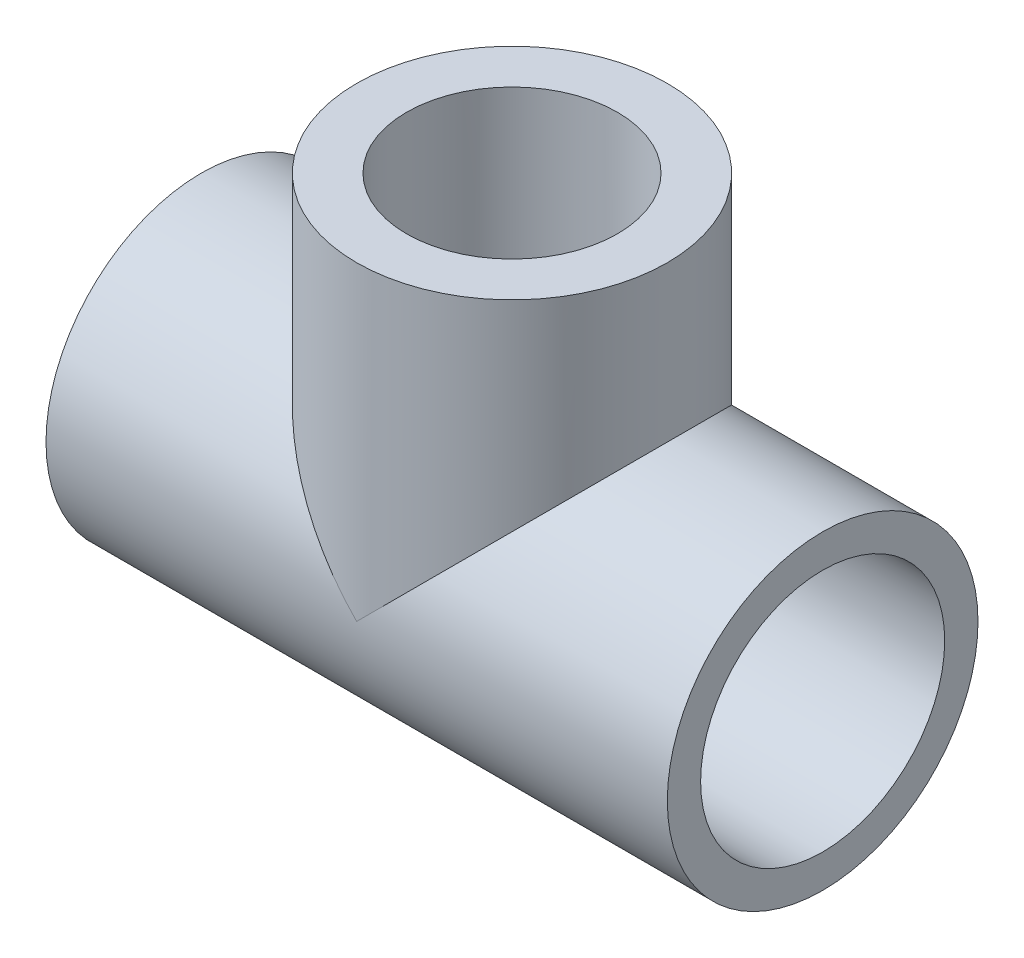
ISO-10303-21;
HEADER;
FILE_DESCRIPTION(('STEP AP214'),'2;1');
FILE_NAME('part.step','',(''),(''),'','','');
FILE_SCHEMA(('AUTOMOTIVE_DESIGN { 1 0 10303 214 1 1 1 1 }'));
ENDSEC;
DATA;
#1=APPLICATION_CONTEXT('core data for automotive mechanical design processes');
#2=APPLICATION_PROTOCOL_DEFINITION('international standard','automotive_design',2000,#1);
#3=PRODUCT_CONTEXT('',#1,'mechanical');
#4=PRODUCT('Part','Part','',(#3));
#5=PRODUCT_RELATED_PRODUCT_CATEGORY('part','',(#4));
#6=PRODUCT_DEFINITION_FORMATION('','',#4);
#7=PRODUCT_DEFINITION_CONTEXT('part definition',#1,'design');
#8=PRODUCT_DEFINITION('design','',#6,#7);
#9=PRODUCT_DEFINITION_SHAPE('','',#8);
#10=(LENGTH_UNIT() NAMED_UNIT(*) SI_UNIT(.MILLI.,.METRE.));
#11=(NAMED_UNIT(*) PLANE_ANGLE_UNIT() SI_UNIT($,.RADIAN.));
#12=(NAMED_UNIT(*) SI_UNIT($,.STERADIAN.) SOLID_ANGLE_UNIT());
#13=UNCERTAINTY_MEASURE_WITH_UNIT(LENGTH_MEASURE(1.E-05),#10,'distance_accuracy_value','');
#14=(GEOMETRIC_REPRESENTATION_CONTEXT(3) GLOBAL_UNCERTAINTY_ASSIGNED_CONTEXT((#13)) GLOBAL_UNIT_ASSIGNED_CONTEXT((#10,
#11,#12)) REPRESENTATION_CONTEXT('',''));
#15=CARTESIAN_POINT('',(0.,0.,0.));
#16=DIRECTION('',(0.,0.,1.));
#17=DIRECTION('',(1.,0.,0.));
#18=AXIS2_PLACEMENT_3D('',#15,#16,#17);
#19=CARTESIAN_POINT('',(-86.4956498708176,0.,0.));
#20=DIRECTION('',(1.,0.,0.));
#21=DIRECTION('',(0.,0.,-1.));
#22=AXIS2_PLACEMENT_3D('',#19,#20,#21);
#23=CYLINDRICAL_SURFACE('',#22,15.494);
#24=CARTESIAN_POINT('',(17.272,0.,0.));
#25=DIRECTION('',(1.,0.,0.));
#26=DIRECTION('',(0.,0.,-1.));
#27=AXIS2_PLACEMENT_3D('',#24,#25,#26);
#28=CIRCLE('',#27,15.494);
#29=CARTESIAN_POINT('',(17.272,0.,-15.494));
#30=VERTEX_POINT('',#29);
#31=EDGE_CURVE('E82',#30,#30,#28,.F.);
#32=ORIENTED_EDGE('',*,*,#31,.F.);
#33=EDGE_LOOP('',(#32));
#34=FACE_BOUND('',#33,.T.);
#35=CARTESIAN_POINT('',(0.,5.51829248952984,14.478));
#36=CARTESIAN_POINT('',(-0.19165666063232,5.51830328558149,14.4779975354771));
#37=CARTESIAN_POINT('',(-0.383393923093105,5.52835492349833,14.4741770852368));
#38=CARTESIAN_POINT('',(-0.764660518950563,5.56778119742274,14.4590547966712));
#39=CARTESIAN_POINT('',(-0.954187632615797,5.59717379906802,14.4477460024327));
#40=CARTESIAN_POINT('',(-1.32998787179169,5.67330377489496,14.4180205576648));
#41=CARTESIAN_POINT('',(-1.516242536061,5.7201185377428,14.399572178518));
#42=CARTESIAN_POINT('',(-1.88373370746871,5.82830327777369,14.3561246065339));
#43=CARTESIAN_POINT('',(-2.06496682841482,5.88968282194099,14.3311211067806));
#44=CARTESIAN_POINT('',(-2.51949151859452,6.06084982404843,14.2598290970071));
#45=CARTESIAN_POINT('',(-2.78904956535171,6.17877523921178,14.209371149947));
#46=CARTESIAN_POINT('',(-3.31607527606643,6.43386751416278,14.0957059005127));
#47=CARTESIAN_POINT('',(-3.57353262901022,6.57105040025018,14.0324879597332));
#48=CARTESIAN_POINT('',(-4.07847666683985,6.85874685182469,13.8941425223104));
#49=CARTESIAN_POINT('',(-4.32593351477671,7.00929655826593,13.8189822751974));
#50=CARTESIAN_POINT('',(-4.81164909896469,7.31905380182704,13.6574534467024));
#51=CARTESIAN_POINT('',(-5.04990473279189,7.47826421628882,13.5710811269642));
#52=CARTESIAN_POINT('',(-5.51228113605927,7.79805593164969,13.3898203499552));
#53=CARTESIAN_POINT('',(-5.73660775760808,7.95849708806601,13.2952074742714));
#54=CARTESIAN_POINT('',(-6.17834824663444,8.2825738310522,13.095771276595));
#55=CARTESIAN_POINT('',(-6.39576107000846,8.44620989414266,12.9909464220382));
#56=CARTESIAN_POINT('',(-6.8242835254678,8.77516598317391,12.7710480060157));
#57=CARTESIAN_POINT('',(-7.03538912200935,8.94048700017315,12.6559680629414));
#58=CARTESIAN_POINT('',(-7.45144041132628,9.27144419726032,12.4155637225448));
#59=CARTESIAN_POINT('',(-7.65638551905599,9.43708040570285,12.2902383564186));
#60=CARTESIAN_POINT('',(-8.26161395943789,9.93235923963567,11.8991165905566));
#61=CARTESIAN_POINT('',(-8.65295711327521,10.2608917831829,11.6178323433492));
#62=CARTESIAN_POINT('',(-9.41057468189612,10.9074191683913,11.0130924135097));
#63=CARTESIAN_POINT('',(-9.77686358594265,11.2254200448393,10.6896614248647));
#64=CARTESIAN_POINT('',(-10.3888015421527,11.7627989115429,10.0904461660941));
#65=CARTESIAN_POINT('',(-10.6407865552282,11.9860651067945,9.82459806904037));
#66=CARTESIAN_POINT('',(-11.128146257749,12.4207504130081,9.268947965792));
#67=CARTESIAN_POINT('',(-11.363521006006,12.6321695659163,8.97914604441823));
#68=CARTESIAN_POINT('',(-11.8151977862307,13.0399790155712,8.37588007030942));
#69=CARTESIAN_POINT('',(-12.031526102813,13.2363899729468,8.06244977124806));
#70=CARTESIAN_POINT('',(-12.4428843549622,13.6113841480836,7.41182464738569));
#71=CARTESIAN_POINT('',(-12.6379191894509,13.7899714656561,7.07463531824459));
#72=CARTESIAN_POINT('',(-12.9659302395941,14.09126031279,6.44939662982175));
#73=CARTESIAN_POINT('',(-13.1034025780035,14.2178847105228,6.16558937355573));
#74=CARTESIAN_POINT('',(-13.3614666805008,14.4560671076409,5.58433110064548));
#75=CARTESIAN_POINT('',(-13.4820622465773,14.5676285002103,5.28688317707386));
#76=CARTESIAN_POINT('',(-13.7047052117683,14.7739210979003,4.67954101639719));
#77=CARTESIAN_POINT('',(-13.8067580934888,14.8686572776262,4.36965049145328));
#78=CARTESIAN_POINT('',(-13.9907362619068,15.039650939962,3.73894023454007));
#79=CARTESIAN_POINT('',(-14.0726613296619,15.1159082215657,3.41812038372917));
#80=CARTESIAN_POINT('',(-14.2154229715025,15.2489056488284,2.76526284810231));
#81=CARTESIAN_POINT('',(-14.276101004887,15.3054990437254,2.43316030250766));
#82=CARTESIAN_POINT('',(-14.3743025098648,15.3971365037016,1.76258926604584));
#83=CARTESIAN_POINT('',(-14.4118259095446,15.4321805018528,1.42412075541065));
#84=CARTESIAN_POINT('',(-14.4628932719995,15.4798821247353,0.743949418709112));
#85=CARTESIAN_POINT('',(-14.4764475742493,15.4925494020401,0.40224805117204));
#86=CARTESIAN_POINT('',(-14.4792999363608,15.4952146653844,-0.281326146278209));
#87=CARTESIAN_POINT('',(-14.4686002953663,15.4852148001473,-0.623198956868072));
#88=CARTESIAN_POINT('',(-14.4258279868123,15.4452587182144,-1.26452252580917));
#89=CARTESIAN_POINT('',(-14.3963701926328,15.4177441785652,-1.56430690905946));
#90=CARTESIAN_POINT('',(-14.3191974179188,15.3457086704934,-2.15941606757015));
#91=CARTESIAN_POINT('',(-14.2714841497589,15.3011892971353,-2.45474125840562));
#92=CARTESIAN_POINT('',(-14.1585672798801,15.1959258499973,-3.0390836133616));
#93=CARTESIAN_POINT('',(-14.0933626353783,15.1351808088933,-3.32810040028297));
#94=CARTESIAN_POINT('',(-13.9464355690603,14.9984630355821,-3.89821627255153));
#95=CARTESIAN_POINT('',(-13.8647122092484,14.9224894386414,-4.17931490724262));
#96=CARTESIAN_POINT('',(-13.6828881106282,14.7537045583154,-4.74143313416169));
#97=CARTESIAN_POINT('',(-13.5822683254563,14.6604189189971,-5.02214171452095));
#98=CARTESIAN_POINT('',(-13.3658223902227,14.4601202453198,-5.57268451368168));
#99=CARTESIAN_POINT('',(-13.2499903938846,14.353101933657,-5.84251449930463));
#100=CARTESIAN_POINT('',(-13.004427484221,14.1267271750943,-6.37040808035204));
#101=CARTESIAN_POINT('',(-12.8746959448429,14.0073701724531,-6.62847114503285));
#102=CARTESIAN_POINT('',(-12.6025574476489,13.7576554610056,-7.13232445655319));
#103=CARTESIAN_POINT('',(-12.4601477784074,13.627295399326,-7.37811206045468));
#104=CARTESIAN_POINT('',(-12.0864527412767,13.2862845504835,-7.98209368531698));
#105=CARTESIAN_POINT('',(-11.8475680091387,13.0692331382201,-8.33201624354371));
#106=CARTESIAN_POINT('',(-11.3466371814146,12.6168985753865,-9.00230755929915));
#107=CARTESIAN_POINT('',(-11.0845808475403,12.3816073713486,-9.3226631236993));
#108=CARTESIAN_POINT('',(-10.5395809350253,11.8961721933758,-9.93468778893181));
#109=CARTESIAN_POINT('',(-10.2565883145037,11.6459936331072,-10.2262855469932));
#110=CARTESIAN_POINT('',(-9.6725165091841,11.1350385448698,-10.7803971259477));
#111=CARTESIAN_POINT('',(-9.37144012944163,10.8742636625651,-11.0429154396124));
#112=CARTESIAN_POINT('',(-8.74477901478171,10.3390242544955,-11.5458570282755));
#113=CARTESIAN_POINT('',(-8.41876770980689,10.0643803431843,-11.785556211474));
#114=CARTESIAN_POINT('',(-7.74973818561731,9.51179882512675,-12.2358790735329));
#115=CARTESIAN_POINT('',(-7.40671533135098,9.23386033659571,-12.446494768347));
#116=CARTESIAN_POINT('',(-6.70405490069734,8.68038106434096,-12.8386016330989));
#117=CARTESIAN_POINT('',(-6.34445695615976,8.4048362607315,-13.0201580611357));
#118=CARTESIAN_POINT('',(-5.60620728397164,7.86244944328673,-13.35467009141));
#119=CARTESIAN_POINT('',(-5.2275677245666,7.59560204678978,-13.5076436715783));
#120=CARTESIAN_POINT('',(-4.49521827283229,7.11281493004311,-13.767252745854));
#121=CARTESIAN_POINT('',(-4.14421540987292,6.894660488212,-13.8772791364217));
#122=CARTESIAN_POINT('',(-3.60110900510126,6.58767748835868,-14.0242490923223));
#123=CARTESIAN_POINT('',(-3.41722384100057,6.48868637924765,-14.0702433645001));
#124=CARTESIAN_POINT('',(-3.04342765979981,6.29983291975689,-14.1558069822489));
#125=CARTESIAN_POINT('',(-2.85351728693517,6.20996959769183,-14.1953770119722));
#126=CARTESIAN_POINT('',(-2.33791265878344,5.98608479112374,-14.2917434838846));
#127=CARTESIAN_POINT('',(-2.00613602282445,5.86258671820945,-14.3424267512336));
#128=CARTESIAN_POINT('',(-1.49615813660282,5.71521593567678,-14.401499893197));
#129=CARTESIAN_POINT('',(-1.32434629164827,5.67243640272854,-14.4183546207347));
#130=CARTESIAN_POINT('',(-0.977280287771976,5.60159095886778,-14.4460256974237));
#131=CARTESIAN_POINT('',(-0.80202849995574,5.57351525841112,-14.4568460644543));
#132=CARTESIAN_POINT('',(-0.446929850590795,5.53351404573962,-14.4722058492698));
#133=CARTESIAN_POINT('',(-0.267052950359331,5.52181663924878,-14.47665657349));
#134=CARTESIAN_POINT('',(0.0930188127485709,5.51614041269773,-14.4788204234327));
#135=CARTESIAN_POINT('',(0.273213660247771,5.52216075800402,-14.4765338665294));
#136=CARTESIAN_POINT('',(0.632280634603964,5.55150745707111,-14.4653046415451));
#137=CARTESIAN_POINT('',(0.811149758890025,5.57486527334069,-14.4563498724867));
#138=CARTESIAN_POINT('',(1.16565573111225,5.63735876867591,-14.4320937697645));
#139=CARTESIAN_POINT('',(1.3412917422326,5.676498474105,-14.4167908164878));
#140=CARTESIAN_POINT('',(1.73236249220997,5.78001696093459,-14.3756482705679));
#141=CARTESIAN_POINT('',(1.94658261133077,5.84828047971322,-14.3481200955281));
#142=CARTESIAN_POINT('',(2.36761439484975,6.00155090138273,-14.2846869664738));
#143=CARTESIAN_POINT('',(2.57442285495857,6.08656494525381,-14.2487784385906));
#144=CARTESIAN_POINT('',(2.98147240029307,6.26957440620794,-14.1692081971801));
#145=CARTESIAN_POINT('',(3.18168850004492,6.36761339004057,-14.1255202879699));
#146=CARTESIAN_POINT('',(3.57548064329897,6.57323445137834,-14.0310171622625));
#147=CARTESIAN_POINT('',(3.76905368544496,6.68082076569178,-13.9801987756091));
#148=CARTESIAN_POINT('',(4.16493414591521,6.91161183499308,-13.8676379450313));
#149=CARTESIAN_POINT('',(4.3667564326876,7.0353808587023,-13.8053542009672));
#150=CARTESIAN_POINT('',(4.76414203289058,7.28870776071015,-13.6733035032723));
#151=CARTESIAN_POINT('',(4.95970606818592,7.41826496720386,-13.6035374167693));
#152=CARTESIAN_POINT('',(5.53845530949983,7.81318601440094,-13.3831541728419));
#153=CARTESIAN_POINT('',(5.91337330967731,8.08460273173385,-13.2215455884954));
#154=CARTESIAN_POINT('',(6.64495470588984,8.63418346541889,-12.8694170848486));
#155=CARTESIAN_POINT('',(7.00159164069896,8.91235644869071,-12.6788567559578));
#156=CARTESIAN_POINT('',(7.69747384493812,9.4688495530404,-12.2688367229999));
#157=CARTESIAN_POINT('',(8.03672564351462,9.74716957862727,-12.0493879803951));
#158=CARTESIAN_POINT('',(8.73504006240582,10.3301293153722,-11.5548458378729));
#159=CARTESIAN_POINT('',(9.09209220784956,10.6342424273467,-11.2762760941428));
#160=CARTESIAN_POINT('',(9.783856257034,11.2314301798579,-10.6816041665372));
#161=CARTESIAN_POINT('',(10.118561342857,11.5245014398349,-10.3654906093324));
#162=CARTESIAN_POINT('',(10.7619322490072,12.0933142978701,-9.69578863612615));
#163=CARTESIAN_POINT('',(11.0706667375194,12.3691010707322,-9.34230500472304));
#164=CARTESIAN_POINT('',(11.6590835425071,12.8984226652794,-8.59671359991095));
#165=CARTESIAN_POINT('',(11.9387835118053,13.1519709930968,-8.20462958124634));
#166=CARTESIAN_POINT('',(12.3729313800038,13.5475466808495,-7.52493139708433));
#167=CARTESIAN_POINT('',(12.5371677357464,13.6977464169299,-7.24826596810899));
#168=CARTESIAN_POINT('',(12.8494451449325,13.9841307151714,-6.67903895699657));
#169=CARTESIAN_POINT('',(12.9974908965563,14.1203193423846,-6.38648202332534));
#170=CARTESIAN_POINT('',(13.2755807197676,14.3767068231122,-5.78625981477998));
#171=CARTESIAN_POINT('',(13.4056294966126,14.4969098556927,-5.47859851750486));
#172=CARTESIAN_POINT('',(13.6458893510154,14.7193677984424,-4.84928916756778));
#173=CARTESIAN_POINT('',(13.7560998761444,14.8216222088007,-4.52764072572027));
#174=CARTESIAN_POINT('',(13.9557249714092,15.0070794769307,-3.86906750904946));
#175=CARTESIAN_POINT('',(14.0449377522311,15.0900973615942,-3.53202895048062));
#176=CARTESIAN_POINT('',(14.1994769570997,15.2340377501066,-2.84785927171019));
#177=CARTESIAN_POINT('',(14.2648033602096,15.2949602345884,-2.50072814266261));
#178=CARTESIAN_POINT('',(14.3700898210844,15.3932022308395,-1.79960074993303));
#179=CARTESIAN_POINT('',(14.4100693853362,15.4305398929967,-1.44560998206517));
#180=CARTESIAN_POINT('',(14.4637859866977,15.4807158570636,-0.733934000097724));
#181=CARTESIAN_POINT('',(14.4775267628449,15.4935576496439,-0.376249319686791));
#182=CARTESIAN_POINT('',(14.4783874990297,15.4943622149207,0.291101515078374));
#183=CARTESIAN_POINT('',(14.4688332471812,15.4854331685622,0.60076843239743));
#184=CARTESIAN_POINT('',(14.4300062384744,15.4491612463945,1.21775085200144));
#185=CARTESIAN_POINT('',(14.4007355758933,15.4218203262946,1.52506660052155));
#186=CARTESIAN_POINT('',(14.3230001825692,15.3492570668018,2.13511646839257));
#187=CARTESIAN_POINT('',(14.2745347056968,15.3040340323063,2.43785040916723));
#188=CARTESIAN_POINT('',(14.1592321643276,15.1965447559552,3.03671236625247));
#189=CARTESIAN_POINT('',(14.0923944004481,15.1342778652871,3.33284013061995));
#190=CARTESIAN_POINT('',(13.9426241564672,14.9949184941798,3.91199899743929));
#191=CARTESIAN_POINT('',(13.8599707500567,14.9180832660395,4.19516470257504));
#192=CARTESIAN_POINT('',(13.6790370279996,14.750134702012,4.75206875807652));
#193=CARTESIAN_POINT('',(13.5807574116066,14.6590220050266,5.0258075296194));
#194=CARTESIAN_POINT('',(13.3697506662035,14.4637541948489,5.56286804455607));
#195=CARTESIAN_POINT('',(13.2570224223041,14.3595980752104,5.82618898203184));
#196=CARTESIAN_POINT('',(13.0183045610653,14.1395074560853,6.34168379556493));
#197=CARTESIAN_POINT('',(12.8923121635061,14.0235704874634,6.59385531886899));
#198=CARTESIAN_POINT('',(12.5668757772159,13.7248683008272,7.20094454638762));
#199=CARTESIAN_POINT('',(12.3604892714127,13.5360680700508,7.54920461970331));
#200=CARTESIAN_POINT('',(11.9250228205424,13.1396194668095,8.21987393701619));
#201=CARTESIAN_POINT('',(11.6959342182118,12.9319639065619,8.54227323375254));
#202=CARTESIAN_POINT('',(11.2172986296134,12.5007403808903,9.16178555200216));
#203=CARTESIAN_POINT('',(10.9676998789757,12.2771323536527,9.45883048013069));
#204=CARTESIAN_POINT('',(10.4509052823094,11.8177396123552,10.0268896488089));
#205=CARTESIAN_POINT('',(10.1837104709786,11.5819556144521,10.2979054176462));
#206=CARTESIAN_POINT('',(9.54962934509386,11.0279798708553,10.8930947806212));
#207=CARTESIAN_POINT('',(9.17716125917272,10.7065568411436,11.2083264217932));
#208=CARTESIAN_POINT('',(8.40740099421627,10.0545374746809,11.796740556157));
#209=CARTESIAN_POINT('',(8.01009377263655,9.72393564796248,12.0698972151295));
#210=CARTESIAN_POINT('',(7.39626224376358,9.2272422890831,12.4485099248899));
#211=CARTESIAN_POINT('',(7.18877144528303,9.06162136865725,12.5694792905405));
#212=CARTESIAN_POINT('',(6.76753390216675,8.73120490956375,12.8012021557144));
#213=CARTESIAN_POINT('',(6.55378780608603,8.56640928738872,12.9119567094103));
#214=CARTESIAN_POINT('',(6.11982999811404,8.23914920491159,13.123199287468));
#215=CARTESIAN_POINT('',(5.89962320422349,8.07668310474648,13.2236948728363));
#216=CARTESIAN_POINT('',(5.45201845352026,7.75575121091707,13.4144388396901));
#217=CARTESIAN_POINT('',(5.22462193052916,7.59728463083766,13.5046892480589));
#218=CARTESIAN_POINT('',(4.80292346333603,7.3143526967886,13.6596293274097));
#219=CARTESIAN_POINT('',(4.60993624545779,7.18885632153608,13.7260092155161));
#220=CARTESIAN_POINT('',(4.21782278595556,6.94392604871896,13.8515288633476));
#221=CARTESIAN_POINT('',(4.01869639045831,6.82449230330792,13.9106684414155));
#222=CARTESIAN_POINT('',(3.61370546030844,6.5941427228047,14.0213271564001));
#223=CARTESIAN_POINT('',(3.40784746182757,6.48321895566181,14.072853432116));
#224=CARTESIAN_POINT('',(2.98858704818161,6.27297885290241,14.1678186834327));
#225=CARTESIAN_POINT('',(2.77518713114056,6.17365871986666,14.2112603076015));
#226=CARTESIAN_POINT('',(2.24109143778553,5.94910354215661,14.3070982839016));
#227=CARTESIAN_POINT('',(1.91560559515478,5.8325278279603,14.3546282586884));
#228=CARTESIAN_POINT('',(1.41595199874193,5.69481636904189,14.4095656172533));
#229=CARTESIAN_POINT('',(1.24773265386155,5.65513334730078,14.4251417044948));
#230=CARTESIAN_POINT('',(0.908160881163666,5.59004717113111,14.4504891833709));
#231=CARTESIAN_POINT('',(0.736810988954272,5.56463294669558,14.4602650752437));
#232=CARTESIAN_POINT('',(0.470841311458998,5.537555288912,14.470646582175));
#233=CARTESIAN_POINT('',(0.37684070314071,5.53034618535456,14.4734010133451));
#234=CARTESIAN_POINT('',(0.188566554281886,5.52071228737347,14.4770782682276));
#235=CARTESIAN_POINT('',(0.0942930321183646,5.51828717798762,14.4780012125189));
#236=CARTESIAN_POINT('',(0.,5.51829248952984,14.478));
#237=B_SPLINE_CURVE_WITH_KNOTS('',3,(#35,#36,#37,#38,#39,#40,#41,#42,#43,#44,#45,#46,#47,#48,
#49,#50,#51,#52,#53,#54,#55,#56,#57,#58,#59,#60,#61,#62,#63,#64,#65,#66,#67,#68,#69,#70,#71,#72,
#73,#74,#75,#76,#77,#78,#79,#80,#81,#82,#83,#84,#85,#86,#87,#88,#89,#90,#91,#92,#93,#94,#95,#96,
#97,#98,#99,#100,#101,#102,#103,#104,#105,#106,#107,#108,#109,#110,#111,#112,#113,#114,#115,
#116,#117,#118,#119,#120,#121,#122,#123,#124,#125,#126,#127,#128,#129,#130,#131,#132,#133,#134,
#135,#136,#137,#138,#139,#140,#141,#142,#143,#144,#145,#146,#147,#148,#149,#150,#151,#152,#153,
#154,#155,#156,#157,#158,#159,#160,#161,#162,#163,#164,#165,#166,#167,#168,#169,#170,#171,#172,
#173,#174,#175,#176,#177,#178,#179,#180,#181,#182,#183,#184,#185,#186,#187,#188,#189,#190,#191,
#192,#193,#194,#195,#196,#197,#198,#199,#200,#201,#202,#203,#204,#205,#206,#207,#208,#209,#210,
#211,#212,#213,#214,#215,#216,#217,#218,#219,#220,#221,#222,#223,#224,#225,#226,#227,#228,#229,
#230,#231,#232,#233,#234,#235,#236),.UNSPECIFIED.,.T.,.F.,(4,2,2,2,2,2,2,2,2,2,2,2,2,2,2,2,2,2,
2,2,2,2,2,2,2,2,2,2,2,2,2,2,2,2,2,2,2,2,2,2,2,2,2,2,2,2,2,2,2,2,2,2,2,2,2,2,2,2,2,2,2,2,2,2,2,2,
2,2,2,2,2,2,2,2,2,2,2,2,2,2,2,2,2,2,2,2,2,2,2,2,2,2,2,2,2,2,2,2,2,2,4),(0.,0.574822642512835,
1.15017998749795,1.72812416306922,2.30644902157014,3.20036947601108,4.09503832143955,
4.99220444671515,5.88967047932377,6.76409458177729,7.63865011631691,8.51375372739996,
9.38894018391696,11.1365854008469,12.8832112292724,14.1691102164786,15.4550046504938,
16.7390957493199,18.0228907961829,19.0414256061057,20.0597305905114,21.0777339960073,
22.0957484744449,23.1212049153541,24.1466645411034,25.1716817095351,26.1966017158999,
27.1029907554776,28.0092947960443,28.9156528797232,29.822062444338,30.7584945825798,
31.6952876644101,32.6321229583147,33.5691590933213,34.9951618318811,36.4217978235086,
37.8518884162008,39.2817577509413,40.7476835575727,42.2140109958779,43.6769978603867,
45.1390614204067,46.4203314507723,47.0615183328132,47.7026368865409,48.7713620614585,
49.3043310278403,49.8369447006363,50.3769048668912,50.9168395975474,51.457756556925,
51.9988116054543,52.6772088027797,53.355895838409,54.036913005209,54.7182339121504,
55.4523378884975,56.1863568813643,57.6555629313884,59.1268388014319,60.5975580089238,
62.2323076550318,63.8675537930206,65.4983306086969,67.1281100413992,68.1924597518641,
69.2564997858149,70.3202611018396,71.3840520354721,72.457682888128,73.5313146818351,
74.6041192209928,75.6767708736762,76.605438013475,77.534006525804,78.4626111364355,
79.3912511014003,80.3048065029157,81.2183210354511,82.1319060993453,83.0456830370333,
84.3837331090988,85.7222954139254,87.0643464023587,88.4063185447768,90.156919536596,
91.9085911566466,92.7836335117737,93.6585854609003,94.5328878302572,95.4070169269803,
96.1255377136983,96.8440765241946,97.5619372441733,98.2795623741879,99.3224665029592,
99.8425090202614,100.362147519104,100.644972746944,100.927779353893),.UNSPECIFIED.);
#238=CARTESIAN_POINT('',(0.,5.51829248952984,14.478));
#239=VERTEX_POINT('',#238);
#240=EDGE_CURVE('E73',#239,#239,#237,.T.);
#241=ORIENTED_EDGE('',*,*,#240,.F.);
#242=EDGE_LOOP('',(#241));
#243=FACE_BOUND('',#242,.T.);
#244=CARTESIAN_POINT('',(-17.272,0.,0.));
#245=DIRECTION('',(-1.,0.,0.));
#246=DIRECTION('',(0.,0.,1.));
#247=AXIS2_PLACEMENT_3D('',#244,#245,#246);
#248=CIRCLE('',#247,15.494);
#249=CARTESIAN_POINT('',(-17.272,0.,15.494));
#250=VERTEX_POINT('',#249);
#251=EDGE_CURVE('E44',#250,#250,#248,.F.);
#252=ORIENTED_EDGE('',*,*,#251,.F.);
#253=EDGE_LOOP('',(#252));
#254=FACE_BOUND('',#253,.T.);
#255=ADVANCED_FACE('F40',(#34,#243,#254),#23,.F.);
#256=CARTESIAN_POINT('',(-42.672,0.,0.));
#257=DIRECTION('',(1.,0.,0.));
#258=DIRECTION('',(0.,0.,-1.));
#259=AXIS2_PLACEMENT_3D('',#256,#257,#258);
#260=PLANE('',#259);
#261=CARTESIAN_POINT('',(-42.672,0.,0.));
#262=DIRECTION('',(1.,0.,0.));
#263=DIRECTION('',(0.,0.,-1.));
#264=AXIS2_PLACEMENT_3D('',#261,#262,#263);
#265=CIRCLE('',#264,21.336);
#266=CARTESIAN_POINT('',(-42.672,0.,-21.336));
#267=VERTEX_POINT('',#266);
#268=EDGE_CURVE('E66',#267,#267,#265,.T.);
#269=ORIENTED_EDGE('',*,*,#268,.F.);
#270=EDGE_LOOP('',(#269));
#271=FACE_BOUND('',#270,.T.);
#272=CARTESIAN_POINT('',(-42.672,0.,0.));
#273=DIRECTION('',(1.,0.,0.));
#274=DIRECTION('',(0.,0.,-1.));
#275=AXIS2_PLACEMENT_3D('',#272,#273,#274);
#276=CIRCLE('',#275,16.764);
#277=CARTESIAN_POINT('',(-42.672,0.,-16.764));
#278=VERTEX_POINT('',#277);
#279=EDGE_CURVE('E123',#278,#278,#276,.T.);
#280=ORIENTED_EDGE('',*,*,#279,.T.);
#281=EDGE_LOOP('',(#280));
#282=FACE_BOUND('',#281,.T.);
#283=ADVANCED_FACE('F89',(#271,#282),#260,.F.);
#284=CARTESIAN_POINT('',(-42.672,0.,0.));
#285=DIRECTION('',(1.,0.,0.));
#286=DIRECTION('',(0.,0.,-1.));
#287=AXIS2_PLACEMENT_3D('',#284,#285,#286);
#288=CYLINDRICAL_SURFACE('',#287,21.336);
#289=CARTESIAN_POINT('',(42.6720000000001,0.,0.));
#290=DIRECTION('',(1.,0.,0.));
#291=DIRECTION('',(0.,0.,-1.));
#292=AXIS2_PLACEMENT_3D('',#289,#290,#291);
#293=CIRCLE('',#292,21.336);
#294=CARTESIAN_POINT('',(42.6720000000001,0.,-21.336));
#295=VERTEX_POINT('',#294);
#296=EDGE_CURVE('E136',#295,#295,#293,.T.);
#297=ORIENTED_EDGE('',*,*,#296,.F.);
#298=EDGE_LOOP('',(#297));
#299=FACE_BOUND('',#298,.T.);
#300=ORIENTED_EDGE('',*,*,#268,.T.);
#301=EDGE_LOOP('',(#300));
#302=FACE_BOUND('',#301,.T.);
#303=CARTESIAN_POINT('',(0.,0.,0.));
#304=DIRECTION('',(0.707106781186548,-0.707106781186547,0.));
#305=DIRECTION('',(-0.707106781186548,-0.707106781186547,0.));
#306=AXIS2_PLACEMENT_3D('',#303,#304,#305);
#307=ELLIPSE('',#306,30.1736605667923,21.336);
#308=CARTESIAN_POINT('',(0.,1.11022302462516E-13,21.336));
#309=VERTEX_POINT('',#308);
#310=CARTESIAN_POINT('',(0.,0.,-21.336));
#311=VERTEX_POINT('',#310);
#312=EDGE_CURVE('E50',#309,#311,#307,.F.);
#313=ORIENTED_EDGE('',*,*,#312,.F.);
#314=CARTESIAN_POINT('',(0.,0.,0.));
#315=DIRECTION('',(-0.707106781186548,-0.707106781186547,0.));
#316=DIRECTION('',(0.707106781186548,-0.707106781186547,0.));
#317=AXIS2_PLACEMENT_3D('',#314,#315,#316);
#318=ELLIPSE('',#317,30.1736605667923,21.336);
#319=EDGE_CURVE('E62',#311,#309,#318,.F.);
#320=ORIENTED_EDGE('',*,*,#319,.F.);
#321=EDGE_LOOP('',(#313,#320));
#322=FACE_BOUND('',#321,.T.);
#323=ADVANCED_FACE('F63',(#299,#302,#322),#288,.T.);
#324=CARTESIAN_POINT('',(42.6720000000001,0.,0.));
#325=DIRECTION('',(1.,0.,0.));
#326=DIRECTION('',(0.,0.,-1.));
#327=AXIS2_PLACEMENT_3D('',#324,#325,#326);
#328=PLANE('',#327);
#329=CARTESIAN_POINT('',(42.6720000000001,0.,0.));
#330=DIRECTION('',(1.,0.,0.));
#331=DIRECTION('',(0.,0.,-1.));
#332=AXIS2_PLACEMENT_3D('',#329,#330,#331);
#333=CIRCLE('',#332,16.764);
#334=CARTESIAN_POINT('',(42.6720000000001,0.,-16.764));
#335=VERTEX_POINT('',#334);
#336=EDGE_CURVE('E116',#335,#335,#333,.T.);
#337=ORIENTED_EDGE('',*,*,#336,.F.);
#338=EDGE_LOOP('',(#337));
#339=FACE_BOUND('',#338,.T.);
#340=ORIENTED_EDGE('',*,*,#296,.T.);
#341=EDGE_LOOP('',(#340));
#342=FACE_BOUND('',#341,.T.);
#343=ADVANCED_FACE('F153',(#339,#342),#328,.T.);
#344=CARTESIAN_POINT('',(0.,42.672,0.));
#345=DIRECTION('',(0.,-1.,0.));
#346=DIRECTION('',(0.,0.,-1.));
#347=AXIS2_PLACEMENT_3D('',#344,#345,#346);
#348=CYLINDRICAL_SURFACE('',#347,21.336);
#349=CARTESIAN_POINT('',(0.,42.672,0.));
#350=DIRECTION('',(0.,1.,0.));
#351=DIRECTION('',(0.,0.,1.));
#352=AXIS2_PLACEMENT_3D('',#349,#350,#351);
#353=CIRCLE('',#352,21.336);
#354=CARTESIAN_POINT('',(0.,42.672,21.336));
#355=VERTEX_POINT('',#354);
#356=EDGE_CURVE('E11',#355,#355,#353,.T.);
#357=ORIENTED_EDGE('',*,*,#356,.F.);
#358=EDGE_LOOP('',(#357));
#359=FACE_BOUND('',#358,.T.);
#360=ORIENTED_EDGE('',*,*,#319,.T.);
#361=ORIENTED_EDGE('',*,*,#312,.T.);
#362=EDGE_LOOP('',(#360,#361));
#363=FACE_BOUND('',#362,.T.);
#364=ADVANCED_FACE('F42',(#359,#363),#348,.T.);
#365=CARTESIAN_POINT('',(0.,42.672,0.));
#366=DIRECTION('',(0.,1.,0.));
#367=DIRECTION('',(0.,0.,1.));
#368=AXIS2_PLACEMENT_3D('',#365,#366,#367);
#369=PLANE('',#368);
#370=CARTESIAN_POINT('',(0.,42.672,0.));
#371=DIRECTION('',(0.,1.,0.));
#372=DIRECTION('',(0.,0.,1.));
#373=AXIS2_PLACEMENT_3D('',#370,#371,#372);
#374=CIRCLE('',#373,14.478);
#375=CARTESIAN_POINT('',(0.,42.672,14.478));
#376=VERTEX_POINT('',#375);
#377=EDGE_CURVE('E81',#376,#376,#374,.T.);
#378=ORIENTED_EDGE('',*,*,#377,.F.);
#379=EDGE_LOOP('',(#378));
#380=FACE_BOUND('',#379,.T.);
#381=ORIENTED_EDGE('',*,*,#356,.T.);
#382=EDGE_LOOP('',(#381));
#383=FACE_BOUND('',#382,.T.);
#384=ADVANCED_FACE('F156',(#380,#383),#369,.T.);
#385=CARTESIAN_POINT('',(0.,0.,0.));
#386=DIRECTION('',(0.,1.,0.));
#387=DIRECTION('',(0.,0.,1.));
#388=AXIS2_PLACEMENT_3D('',#385,#386,#387);
#389=CYLINDRICAL_SURFACE('',#388,14.478);
#390=ORIENTED_EDGE('',*,*,#240,.T.);
#391=EDGE_LOOP('',(#390));
#392=FACE_BOUND('',#391,.T.);
#393=ORIENTED_EDGE('',*,*,#377,.T.);
#394=EDGE_LOOP('',(#393));
#395=FACE_BOUND('',#394,.T.);
#396=ADVANCED_FACE('F83',(#392,#395),#389,.F.);
#397=CARTESIAN_POINT('',(17.272,0.,0.));
#398=DIRECTION('',(1.,0.,0.));
#399=DIRECTION('',(0.,0.,-1.));
#400=AXIS2_PLACEMENT_3D('',#397,#398,#399);
#401=PLANE('',#400);
#402=CARTESIAN_POINT('',(17.272,0.,0.));
#403=DIRECTION('',(1.,0.,0.));
#404=DIRECTION('',(0.,0.,-1.));
#405=AXIS2_PLACEMENT_3D('',#402,#403,#404);
#406=CIRCLE('',#405,16.764);
#407=CARTESIAN_POINT('',(17.272,0.,-16.764));
#408=VERTEX_POINT('',#407);
#409=EDGE_CURVE('E121',#408,#408,#406,.T.);
#410=ORIENTED_EDGE('',*,*,#409,.T.);
#411=EDGE_LOOP('',(#410));
#412=FACE_BOUND('',#411,.T.);
#413=ORIENTED_EDGE('',*,*,#31,.T.);
#414=EDGE_LOOP('',(#413));
#415=FACE_BOUND('',#414,.T.);
#416=ADVANCED_FACE('F95',(#412,#415),#401,.T.);
#417=CARTESIAN_POINT('',(17.272,0.,0.));
#418=DIRECTION('',(1.,0.,0.));
#419=DIRECTION('',(0.,0.,-1.));
#420=AXIS2_PLACEMENT_3D('',#417,#418,#419);
#421=CYLINDRICAL_SURFACE('',#420,16.764);
#422=ORIENTED_EDGE('',*,*,#409,.F.);
#423=EDGE_LOOP('',(#422));
#424=FACE_BOUND('',#423,.T.);
#425=ORIENTED_EDGE('',*,*,#336,.T.);
#426=EDGE_LOOP('',(#425));
#427=FACE_BOUND('',#426,.T.);
#428=ADVANCED_FACE('F91',(#424,#427),#421,.F.);
#429=CARTESIAN_POINT('',(-17.272,0.,0.));
#430=DIRECTION('',(-1.,0.,0.));
#431=DIRECTION('',(0.,0.,-1.));
#432=AXIS2_PLACEMENT_3D('',#429,#430,#431);
#433=PLANE('',#432);
#434=CARTESIAN_POINT('',(-17.272,0.,0.));
#435=DIRECTION('',(1.,0.,0.));
#436=DIRECTION('',(0.,0.,-1.));
#437=AXIS2_PLACEMENT_3D('',#434,#435,#436);
#438=CIRCLE('',#437,16.764);
#439=CARTESIAN_POINT('',(-17.272,0.,-16.764));
#440=VERTEX_POINT('',#439);
#441=EDGE_CURVE('E111',#440,#440,#438,.T.);
#442=ORIENTED_EDGE('',*,*,#441,.F.);
#443=EDGE_LOOP('',(#442));
#444=FACE_BOUND('',#443,.T.);
#445=ORIENTED_EDGE('',*,*,#251,.T.);
#446=EDGE_LOOP('',(#445));
#447=FACE_BOUND('',#446,.T.);
#448=ADVANCED_FACE('F94',(#444,#447),#433,.T.);
#449=CARTESIAN_POINT('',(-17.272,0.,0.));
#450=DIRECTION('',(-1.,0.,0.));
#451=DIRECTION('',(0.,0.,1.));
#452=AXIS2_PLACEMENT_3D('',#449,#450,#451);
#453=CYLINDRICAL_SURFACE('',#452,16.764);
#454=ORIENTED_EDGE('',*,*,#441,.T.);
#455=EDGE_LOOP('',(#454));
#456=FACE_BOUND('',#455,.T.);
#457=ORIENTED_EDGE('',*,*,#279,.F.);
#458=EDGE_LOOP('',(#457));
#459=FACE_BOUND('',#458,.T.);
#460=ADVANCED_FACE('F100',(#456,#459),#453,.F.);
#461=CLOSED_SHELL('',(#255,#283,#323,#343,#364,#384,#396,#416,#428,#448,#460));
#462=MANIFOLD_SOLID_BREP('B2',#461);
#463=ADVANCED_BREP_SHAPE_REPRESENTATION('',(#18,#462),#14);
#464=SHAPE_DEFINITION_REPRESENTATION(#9,#463);
ENDSEC;
END-ISO-10303-21;
